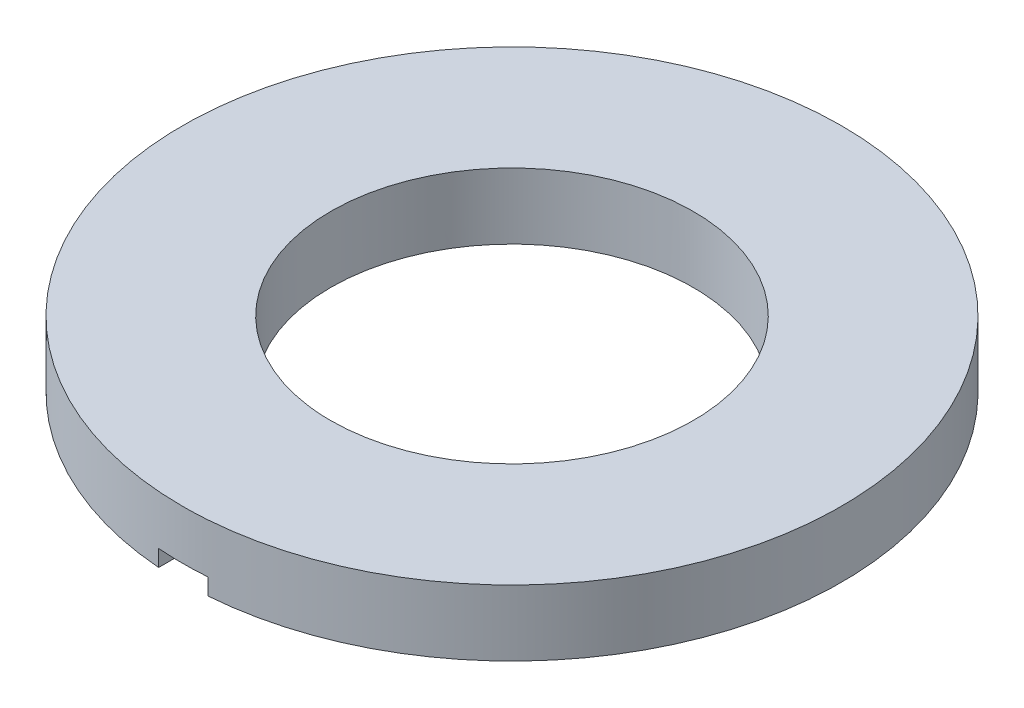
from build123d import *

# Parameters (mm, degrees)
SKETCH1_R          = 10
SKETCH1_R_2        = 5.5
EXTRUDE1_DEPTH     = 2
SKETCH2_W          = 1.5
SKETCH2_H          = 9
CUT_EXTRUDE1_DEPTH = 0.5


with BuildPart() as part:
    # Sketch1 → Extrude1 (new body)
    with BuildSketch(Plane(origin=(0, 0, 0), x_dir=(1, 0, 0), z_dir=(0, 1, 0))):
        with Locations(Location((0, 0, 0), (0, 0, 270))):
            Circle(SKETCH1_R)
        with Locations(Location((0, 0, 0), (0, 0, 270))):
            Circle(SKETCH1_R_2, mode=Mode.SUBTRACT)
    extrude(amount=EXTRUDE1_DEPTH)

    # Sketch2 → Cut-Extrude1 (cut)
    with BuildSketch(Plane.XZ):
        with Locations((0, 5.5)):
            Rectangle(SKETCH2_W, SKETCH2_H)
    extrude(amount=-CUT_EXTRUDE1_DEPTH, mode=Mode.SUBTRACT)


solid = part.part
